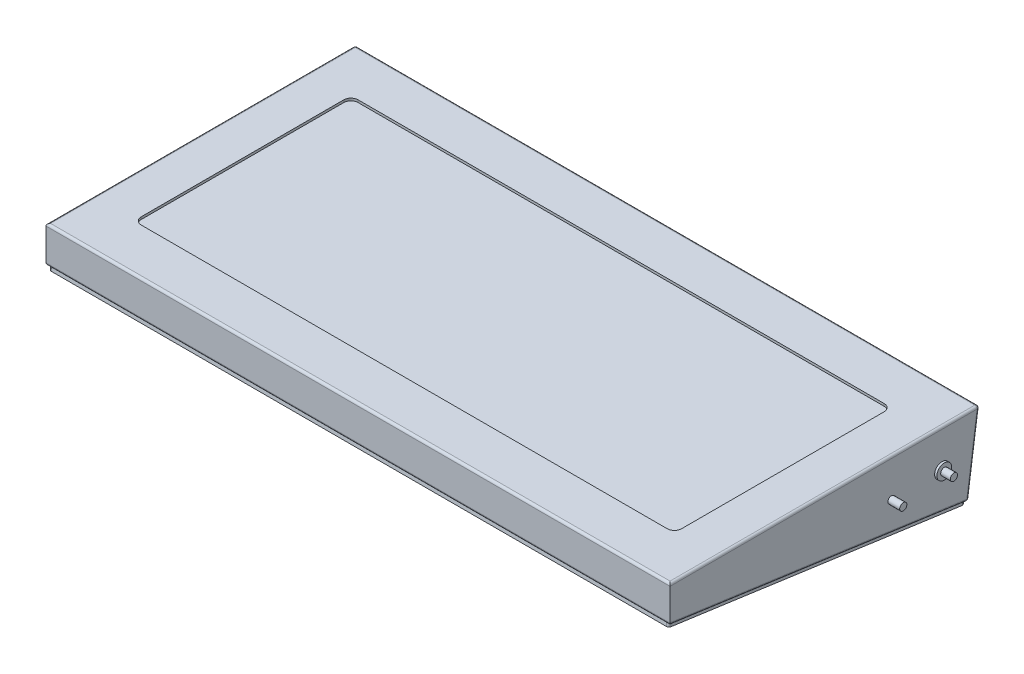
from build123d import *

# Parameters (mm, degrees)
ENCLOSURE_BODY_DEPTH    = 208.28
RADII_R                 = 1.524
KEYS_EXTRUDE_DEPTH      = 1.6002
SKETCH9_R               = 2.3876
SKETCH9_R_2             = 2.413
PINS_RIGHT_SIDE_DEPTH   = 7.9248
SKETCH10_R              = 5.9817
PIN_WELD_NUT_DEPTH      = 9.525
SUB_PANEL_EMBOSS_DEPTH  = 2.286
SKETCH11_R              = 9.525
GORE_VENT_DEPTH         = 6.35
SKETCH12_R              = 3.937
CABLE_ENTRY_DEPTH       = 12.7
SKETCH13_R              = 4.953
WASHER_RIGHT_SIDE_DEPTH = 1.524
SKETCH14_R              = 17.526
WASHER_LEFT_SIDE_DEPTH  = 1.524


with BuildPart() as part:
    # Sketch2 → Enclosure Body (new, symmetric)
    with BuildSketch(Plane(origin=(0, 0, 0), x_dir=(0, 0, -1), z_dir=(1, 0, 0))):
        Polygon((-7.296233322, -51.915397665), (0, 0), (-206.685485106, 0), (-206.660813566, -24.104587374), align=None)
    extrude(amount=ENCLOSURE_BODY_DEPTH, both=True)

    # Radii
    radii_edges = [part.edges().sort_by_distance(p)[0] for p in [
        (208.28, -38.009992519, 106.978523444),
        (208.28, -25.957698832, 3.648116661),
        (208.28, 0, 103.342742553),
        (-208.28, -25.957698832, 3.648116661),
        (-208.28, -38.009992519, 106.978523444),
        (-208.28, 0, 103.342742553),
        (0, 0, 0),
        (0, -51.915397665, 7.296233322),
        (0, -24.104587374, 206.660813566),
        (0, 0, 206.685485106),
    ]]
    fillet(radii_edges, radius=RADII_R)

    # Sketch3 → Keys Extrude (cut)
    with BuildSketch(Plane(origin=(0, 0, 0), x_dir=(1, 0, 0), z_dir=(0, 1, 0))):
        with BuildLine():
            Line((-175.5648, -31.066542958), (175.5648, -31.066542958))
            ThreePointArc((175.5648, -31.066542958), (178.941376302, -32.465166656), (180.34, -35.841742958))
            Line((180.34, -35.841742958), (180.34, -171.071342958))
            ThreePointArc((180.34, -171.071342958), (178.941376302, -174.447919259), (175.5648, -175.846542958))
            Line((175.5648, -175.846542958), (-175.5648, -175.846542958))
            ThreePointArc((-175.5648, -175.846542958), (-178.941376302, -174.447919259), (-180.34, -171.071342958))
            Line((-180.34, -171.071342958), (-180.34, -35.841742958))
            ThreePointArc((-180.34, -35.841742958), (-178.941376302, -32.465166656), (-175.5648, -31.066542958))
        make_face()
    extrude(amount=-KEYS_EXTRUDE_DEPTH, mode=Mode.SUBTRACT)

    # Sketch9 → Pins_ Right Side (add)
    with BuildSketch(Plane(origin=(208.28, 0, 0), x_dir=(0, 0, -1), z_dir=(1, 0, 0))):
        with Locations((-58.928, -25.4)):
            Circle(SKETCH9_R)
        with Locations((-25.146, -25.146)):
            Circle(SKETCH9_R_2)
    pins_right_side = extrude(amount=PINS_RIGHT_SIDE_DEPTH)

    # Pins_ Left Side: Pins_ Right Side across plane
    add(pins_right_side.mirror(Plane(origin=(0, 0, 0), x_dir=(0, 0, 1), z_dir=(1, 0, 0))))

    # Sketch10 → Pin_ Weld Nut (add)
    with BuildSketch(Plane.ZY.offset(208.28)):
        with Locations(Location((25.146, -25.146, 0), (0, 0, 180))):
            Circle(SKETCH10_R)
    extrude(amount=PIN_WELD_NUT_DEPTH)

    # Sketch4 → Sub-panel Emboss (add)
    with BuildSketch(Plane(origin=(0, -51.922811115, 7.243089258), x_dir=(1, 0, 0), z_dir=(0, -0.9904099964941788, 0.13815946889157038))):
        with BuildLine():
            Line((-205.232, 200.517034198), (205.232, 200.517034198))
            ThreePointArc((205.232, 200.517034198), (206.309630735, 200.070664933), (206.756, 198.993034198))
            Line((206.756, 198.993034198), (206.756, 2.592100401))
            ThreePointArc((206.756, 2.592100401), (206.309630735, 1.514469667), (205.232, 1.068100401))
            Line((205.232, 1.068100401), (-205.232, 1.068100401))
            ThreePointArc((-205.232, 1.068100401), (-206.309630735, 1.514469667), (-206.756, 2.592100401))
            Line((-206.756, 2.592100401), (-206.756, 198.993034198))
            ThreePointArc((-206.756, 198.993034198), (-206.309630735, 200.070664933), (-205.232, 200.517034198))
        make_face()
    extrude(amount=SUB_PANEL_EMBOSS_DEPTH)

    # Sketch11 → Gore Vent (add)
    with BuildSketch(Plane(origin=(0, -54.186888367, 7.558921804), x_dir=(1, 0, 0), z_dir=(0, -0.9904099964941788, 0.1381594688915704))):
        with Locations(Location((0, 100.7925673, 0), (0, 0, 270))):
            Circle(SKETCH11_R)
    extrude(amount=GORE_VENT_DEPTH)

    # Sketch12 → Cable Entry (cut)
    with BuildSketch(Plane.ZY.offset(217.805)):
        with Locations((25.146, -25.146)):
            Circle(SKETCH12_R)
    extrude(amount=-CABLE_ENTRY_DEPTH, mode=Mode.SUBTRACT)

    # Sketch13 → Washer_ Right Side (add)
    with BuildSketch(Plane(origin=(208.28, 0, 0), x_dir=(0, 0, -1), z_dir=(1, 0, 0))):
        with Locations(Location((-25.146, -25.146, 0), (0, 0, 180))):
            Circle(SKETCH13_R)
    extrude(amount=WASHER_RIGHT_SIDE_DEPTH)

    # Sketch14 → Washer_ Left Side (add)
    with BuildSketch(Plane.ZY.offset(208.28)):
        with Locations(Location((25.146, -25.146, 0), (0, 0, 180))):
            Circle(SKETCH14_R)
    extrude(amount=WASHER_LEFT_SIDE_DEPTH)


solid = part.part
